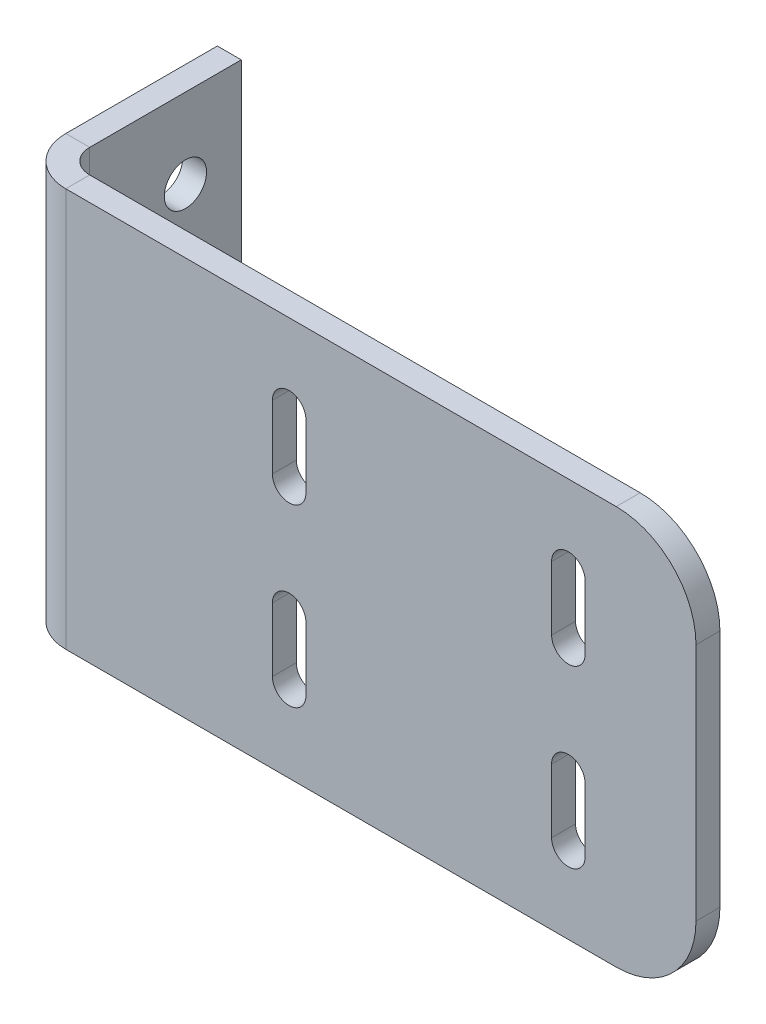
ISO-10303-21;
HEADER;
FILE_DESCRIPTION(('STEP AP214'),'2;1');
FILE_NAME('part.step','',(''),(''),'','','');
FILE_SCHEMA(('AUTOMOTIVE_DESIGN { 1 0 10303 214 1 1 1 1 }'));
ENDSEC;
DATA;
#1=APPLICATION_CONTEXT('core data for automotive mechanical design processes');
#2=APPLICATION_PROTOCOL_DEFINITION('international standard','automotive_design',2000,#1);
#3=PRODUCT_CONTEXT('',#1,'mechanical');
#4=PRODUCT('Part','Part','',(#3));
#5=PRODUCT_RELATED_PRODUCT_CATEGORY('part','',(#4));
#6=PRODUCT_DEFINITION_FORMATION('','',#4);
#7=PRODUCT_DEFINITION_CONTEXT('part definition',#1,'design');
#8=PRODUCT_DEFINITION('design','',#6,#7);
#9=PRODUCT_DEFINITION_SHAPE('','',#8);
#10=(LENGTH_UNIT() NAMED_UNIT(*) SI_UNIT(.MILLI.,.METRE.));
#11=(NAMED_UNIT(*) PLANE_ANGLE_UNIT() SI_UNIT($,.RADIAN.));
#12=(NAMED_UNIT(*) SI_UNIT($,.STERADIAN.) SOLID_ANGLE_UNIT());
#13=UNCERTAINTY_MEASURE_WITH_UNIT(LENGTH_MEASURE(1.E-05),#10,'distance_accuracy_value','');
#14=(GEOMETRIC_REPRESENTATION_CONTEXT(3) GLOBAL_UNCERTAINTY_ASSIGNED_CONTEXT((#13)) GLOBAL_UNIT_ASSIGNED_CONTEXT((#10,
#11,#12)) REPRESENTATION_CONTEXT('',''));
#15=CARTESIAN_POINT('',(0.,0.,0.));
#16=DIRECTION('',(0.,0.,1.));
#17=DIRECTION('',(1.,0.,0.));
#18=AXIS2_PLACEMENT_3D('',#15,#16,#17);
#19=CARTESIAN_POINT('',(0.,50.,3.));
#20=DIRECTION('',(0.,0.,-1.));
#21=DIRECTION('',(-1.,0.,0.));
#22=AXIS2_PLACEMENT_3D('',#19,#20,#21);
#23=PLANE('',#22);
#24=CARTESIAN_POINT('',(66.,18.,3.));
#25=DIRECTION('',(0.,0.,1.));
#26=DIRECTION('',(1.,0.,0.));
#27=AXIS2_PLACEMENT_3D('',#24,#25,#26);
#28=CIRCLE('',#27,2.1);
#29=CARTESIAN_POINT('',(68.1,18.,3.));
#30=VERTEX_POINT('',#29);
#31=CARTESIAN_POINT('',(63.9,18.,3.));
#32=VERTEX_POINT('',#31);
#33=EDGE_CURVE('E277',#30,#32,#28,.T.);
#34=ORIENTED_EDGE('',*,*,#33,.F.);
#35=DIRECTION('',(0.,1.,0.));
#36=VECTOR('',#35,1.);
#37=CARTESIAN_POINT('',(68.1,18.,3.));
#38=LINE('',#37,#36);
#39=CARTESIAN_POINT('',(68.1,10.,3.));
#40=VERTEX_POINT('',#39);
#41=EDGE_CURVE('E285',#40,#30,#38,.T.);
#42=ORIENTED_EDGE('',*,*,#41,.F.);
#43=CARTESIAN_POINT('',(66.,10.,3.));
#44=DIRECTION('',(0.,0.,1.));
#45=DIRECTION('',(1.,0.,0.));
#46=AXIS2_PLACEMENT_3D('',#43,#44,#45);
#47=CIRCLE('',#46,2.1);
#48=CARTESIAN_POINT('',(63.9,10.,3.));
#49=VERTEX_POINT('',#48);
#50=EDGE_CURVE('E282',#49,#40,#47,.T.);
#51=ORIENTED_EDGE('',*,*,#50,.F.);
#52=DIRECTION('',(0.,-1.,0.));
#53=VECTOR('',#52,1.);
#54=CARTESIAN_POINT('',(63.9,18.,3.));
#55=LINE('',#54,#53);
#56=EDGE_CURVE('E279',#32,#49,#55,.T.);
#57=ORIENTED_EDGE('',*,*,#56,.F.);
#58=EDGE_LOOP('',(#34,#42,#51,#57));
#59=FACE_BOUND('',#58,.T.);
#60=CARTESIAN_POINT('',(31.,18.,3.));
#61=DIRECTION('',(0.,0.,1.));
#62=DIRECTION('',(1.,0.,0.));
#63=AXIS2_PLACEMENT_3D('',#60,#61,#62);
#64=CIRCLE('',#63,2.10000000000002);
#65=CARTESIAN_POINT('',(33.1,18.,3.));
#66=VERTEX_POINT('',#65);
#67=CARTESIAN_POINT('',(28.9,18.,3.));
#68=VERTEX_POINT('',#67);
#69=EDGE_CURVE('E339',#66,#68,#64,.T.);
#70=ORIENTED_EDGE('',*,*,#69,.F.);
#71=DIRECTION('',(0.,1.,0.));
#72=VECTOR('',#71,1.);
#73=CARTESIAN_POINT('',(33.1,18.,3.));
#74=LINE('',#73,#72);
#75=CARTESIAN_POINT('',(33.1,10.,3.));
#76=VERTEX_POINT('',#75);
#77=EDGE_CURVE('E347',#76,#66,#74,.T.);
#78=ORIENTED_EDGE('',*,*,#77,.F.);
#79=CARTESIAN_POINT('',(31.,10.,3.));
#80=DIRECTION('',(0.,0.,1.));
#81=DIRECTION('',(1.,0.,0.));
#82=AXIS2_PLACEMENT_3D('',#79,#80,#81);
#83=CIRCLE('',#82,2.10000000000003);
#84=CARTESIAN_POINT('',(28.9,10.,3.));
#85=VERTEX_POINT('',#84);
#86=EDGE_CURVE('E344',#85,#76,#83,.T.);
#87=ORIENTED_EDGE('',*,*,#86,.F.);
#88=DIRECTION('',(0.,-1.,0.));
#89=VECTOR('',#88,1.);
#90=CARTESIAN_POINT('',(28.9,18.,3.));
#91=LINE('',#90,#89);
#92=EDGE_CURVE('E341',#68,#85,#91,.T.);
#93=ORIENTED_EDGE('',*,*,#92,.F.);
#94=EDGE_LOOP('',(#70,#78,#87,#93));
#95=FACE_BOUND('',#94,.T.);
#96=CARTESIAN_POINT('',(31.,40.,3.));
#97=DIRECTION('',(0.,0.,1.));
#98=DIRECTION('',(1.,0.,0.));
#99=AXIS2_PLACEMENT_3D('',#96,#97,#98);
#100=CIRCLE('',#99,2.10000000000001);
#101=CARTESIAN_POINT('',(33.1,40.,3.));
#102=VERTEX_POINT('',#101);
#103=CARTESIAN_POINT('',(28.9,40.,3.));
#104=VERTEX_POINT('',#103);
#105=EDGE_CURVE('E370',#102,#104,#100,.T.);
#106=ORIENTED_EDGE('',*,*,#105,.F.);
#107=DIRECTION('',(0.,1.,0.));
#108=VECTOR('',#107,1.);
#109=CARTESIAN_POINT('',(33.1,40.,3.));
#110=LINE('',#109,#108);
#111=CARTESIAN_POINT('',(33.1,32.,3.));
#112=VERTEX_POINT('',#111);
#113=EDGE_CURVE('E378',#112,#102,#110,.T.);
#114=ORIENTED_EDGE('',*,*,#113,.F.);
#115=CARTESIAN_POINT('',(31.,32.,3.));
#116=DIRECTION('',(0.,0.,1.));
#117=DIRECTION('',(1.,0.,0.));
#118=AXIS2_PLACEMENT_3D('',#115,#116,#117);
#119=CIRCLE('',#118,2.10000000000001);
#120=CARTESIAN_POINT('',(28.9,32.,3.));
#121=VERTEX_POINT('',#120);
#122=EDGE_CURVE('E375',#121,#112,#119,.T.);
#123=ORIENTED_EDGE('',*,*,#122,.F.);
#124=DIRECTION('',(0.,-1.,0.));
#125=VECTOR('',#124,1.);
#126=CARTESIAN_POINT('',(28.9,40.,3.));
#127=LINE('',#126,#125);
#128=EDGE_CURVE('E372',#104,#121,#127,.T.);
#129=ORIENTED_EDGE('',*,*,#128,.F.);
#130=EDGE_LOOP('',(#106,#114,#123,#129));
#131=FACE_BOUND('',#130,.T.);
#132=CARTESIAN_POINT('',(66.,40.,3.));
#133=DIRECTION('',(0.,0.,1.));
#134=DIRECTION('',(1.,0.,0.));
#135=AXIS2_PLACEMENT_3D('',#132,#133,#134);
#136=CIRCLE('',#135,2.10000000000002);
#137=CARTESIAN_POINT('',(68.1,40.,3.));
#138=VERTEX_POINT('',#137);
#139=CARTESIAN_POINT('',(63.9,40.,3.));
#140=VERTEX_POINT('',#139);
#141=EDGE_CURVE('E308',#138,#140,#136,.T.);
#142=ORIENTED_EDGE('',*,*,#141,.F.);
#143=DIRECTION('',(0.,1.,0.));
#144=VECTOR('',#143,1.);
#145=CARTESIAN_POINT('',(68.1,40.,3.));
#146=LINE('',#145,#144);
#147=CARTESIAN_POINT('',(68.1,32.,3.));
#148=VERTEX_POINT('',#147);
#149=EDGE_CURVE('E316',#148,#138,#146,.T.);
#150=ORIENTED_EDGE('',*,*,#149,.F.);
#151=CARTESIAN_POINT('',(66.,32.,3.));
#152=DIRECTION('',(0.,0.,1.));
#153=DIRECTION('',(1.,0.,0.));
#154=AXIS2_PLACEMENT_3D('',#151,#152,#153);
#155=CIRCLE('',#154,2.10000000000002);
#156=CARTESIAN_POINT('',(63.9,32.,3.));
#157=VERTEX_POINT('',#156);
#158=EDGE_CURVE('E313',#157,#148,#155,.T.);
#159=ORIENTED_EDGE('',*,*,#158,.F.);
#160=DIRECTION('',(0.,-1.,0.));
#161=VECTOR('',#160,1.);
#162=CARTESIAN_POINT('',(63.9,40.,3.));
#163=LINE('',#162,#161);
#164=EDGE_CURVE('E310',#140,#157,#163,.T.);
#165=ORIENTED_EDGE('',*,*,#164,.F.);
#166=EDGE_LOOP('',(#142,#150,#159,#165));
#167=FACE_BOUND('',#166,.T.);
#168=DIRECTION('',(0.,1.,0.));
#169=VECTOR('',#168,1.);
#170=CARTESIAN_POINT('',(82.,0.,3.));
#171=LINE('',#170,#169);
#172=CARTESIAN_POINT('',(82.,10.,3.));
#173=VERTEX_POINT('',#172);
#174=CARTESIAN_POINT('',(82.,40.,3.));
#175=VERTEX_POINT('',#174);
#176=EDGE_CURVE('E403',#173,#175,#171,.T.);
#177=ORIENTED_EDGE('',*,*,#176,.T.);
#178=CARTESIAN_POINT('',(72.,40.,3.));
#179=DIRECTION('',(0.,0.,-1.));
#180=DIRECTION('',(-1.,0.,0.));
#181=AXIS2_PLACEMENT_3D('',#178,#179,#180);
#182=CIRCLE('',#181,10.);
#183=CARTESIAN_POINT('',(72.,50.,3.));
#184=VERTEX_POINT('',#183);
#185=EDGE_CURVE('E42',#175,#184,#182,.F.);
#186=ORIENTED_EDGE('',*,*,#185,.T.);
#187=DIRECTION('',(-1.,0.,0.));
#188=VECTOR('',#187,1.);
#189=CARTESIAN_POINT('',(0.,50.,3.));
#190=LINE('',#189,#188);
#191=CARTESIAN_POINT('',(2.99999999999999,50.,3.));
#192=VERTEX_POINT('',#191);
#193=EDGE_CURVE('E406',#184,#192,#190,.T.);
#194=ORIENTED_EDGE('',*,*,#193,.T.);
#195=DIRECTION('',(0.,1.,0.));
#196=VECTOR('',#195,1.);
#197=CARTESIAN_POINT('',(2.99999999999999,50.,3.));
#198=LINE('',#197,#196);
#199=CARTESIAN_POINT('',(2.99999999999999,0.,3.));
#200=VERTEX_POINT('',#199);
#201=EDGE_CURVE('E216',#192,#200,#198,.F.);
#202=ORIENTED_EDGE('',*,*,#201,.T.);
#203=DIRECTION('',(1.,0.,0.));
#204=VECTOR('',#203,1.);
#205=CARTESIAN_POINT('',(0.,0.,3.));
#206=LINE('',#205,#204);
#207=CARTESIAN_POINT('',(72.,0.,3.));
#208=VERTEX_POINT('',#207);
#209=EDGE_CURVE('E401',#200,#208,#206,.T.);
#210=ORIENTED_EDGE('',*,*,#209,.T.);
#211=CARTESIAN_POINT('',(72.,10.,3.));
#212=DIRECTION('',(0.,0.,-1.));
#213=DIRECTION('',(-1.,0.,0.));
#214=AXIS2_PLACEMENT_3D('',#211,#212,#213);
#215=CIRCLE('',#214,10.);
#216=EDGE_CURVE('E423',#208,#173,#215,.F.);
#217=ORIENTED_EDGE('',*,*,#216,.T.);
#218=EDGE_LOOP('',(#177,#186,#194,#202,#210,#217));
#219=FACE_BOUND('',#218,.T.);
#220=ADVANCED_FACE('F34',(#59,#95,#131,#167,#219),#23,.F.);
#221=CARTESIAN_POINT('',(0.,50.,0.));
#222=DIRECTION('',(0.,0.,-1.));
#223=DIRECTION('',(-1.,0.,0.));
#224=AXIS2_PLACEMENT_3D('',#221,#222,#223);
#225=PLANE('',#224);
#226=DIRECTION('',(0.,1.,0.));
#227=VECTOR('',#226,1.);
#228=CARTESIAN_POINT('',(68.1,18.,0.));
#229=LINE('',#228,#227);
#230=CARTESIAN_POINT('',(68.1,10.,0.));
#231=VERTEX_POINT('',#230);
#232=CARTESIAN_POINT('',(68.1,18.,0.));
#233=VERTEX_POINT('',#232);
#234=EDGE_CURVE('E280',#231,#233,#229,.T.);
#235=ORIENTED_EDGE('',*,*,#234,.T.);
#236=CARTESIAN_POINT('',(66.,18.,0.));
#237=DIRECTION('',(0.,0.,1.));
#238=DIRECTION('',(1.,0.,0.));
#239=AXIS2_PLACEMENT_3D('',#236,#237,#238);
#240=CIRCLE('',#239,2.1);
#241=CARTESIAN_POINT('',(63.9,18.,0.));
#242=VERTEX_POINT('',#241);
#243=EDGE_CURVE('E274',#233,#242,#240,.T.);
#244=ORIENTED_EDGE('',*,*,#243,.T.);
#245=DIRECTION('',(0.,-1.,0.));
#246=VECTOR('',#245,1.);
#247=CARTESIAN_POINT('',(63.9,18.,0.));
#248=LINE('',#247,#246);
#249=CARTESIAN_POINT('',(63.9,10.,0.));
#250=VERTEX_POINT('',#249);
#251=EDGE_CURVE('E290',#242,#250,#248,.T.);
#252=ORIENTED_EDGE('',*,*,#251,.T.);
#253=CARTESIAN_POINT('',(66.,10.,0.));
#254=DIRECTION('',(0.,0.,1.));
#255=DIRECTION('',(1.,0.,0.));
#256=AXIS2_PLACEMENT_3D('',#253,#254,#255);
#257=CIRCLE('',#256,2.1);
#258=EDGE_CURVE('E293',#250,#231,#257,.T.);
#259=ORIENTED_EDGE('',*,*,#258,.T.);
#260=EDGE_LOOP('',(#235,#244,#252,#259));
#261=FACE_BOUND('',#260,.T.);
#262=DIRECTION('',(0.,1.,0.));
#263=VECTOR('',#262,1.);
#264=CARTESIAN_POINT('',(33.1,18.,0.));
#265=LINE('',#264,#263);
#266=CARTESIAN_POINT('',(33.1,10.,0.));
#267=VERTEX_POINT('',#266);
#268=CARTESIAN_POINT('',(33.1,18.,0.));
#269=VERTEX_POINT('',#268);
#270=EDGE_CURVE('E342',#267,#269,#265,.T.);
#271=ORIENTED_EDGE('',*,*,#270,.T.);
#272=CARTESIAN_POINT('',(31.,18.,0.));
#273=DIRECTION('',(0.,0.,1.));
#274=DIRECTION('',(1.,0.,0.));
#275=AXIS2_PLACEMENT_3D('',#272,#273,#274);
#276=CIRCLE('',#275,2.10000000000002);
#277=CARTESIAN_POINT('',(28.9,18.,0.));
#278=VERTEX_POINT('',#277);
#279=EDGE_CURVE('E338',#269,#278,#276,.T.);
#280=ORIENTED_EDGE('',*,*,#279,.T.);
#281=DIRECTION('',(0.,-1.,0.));
#282=VECTOR('',#281,1.);
#283=CARTESIAN_POINT('',(28.9,18.,0.));
#284=LINE('',#283,#282);
#285=CARTESIAN_POINT('',(28.9,10.,0.));
#286=VERTEX_POINT('',#285);
#287=EDGE_CURVE('E352',#278,#286,#284,.T.);
#288=ORIENTED_EDGE('',*,*,#287,.T.);
#289=CARTESIAN_POINT('',(31.,10.,0.));
#290=DIRECTION('',(0.,0.,1.));
#291=DIRECTION('',(1.,0.,0.));
#292=AXIS2_PLACEMENT_3D('',#289,#290,#291);
#293=CIRCLE('',#292,2.10000000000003);
#294=EDGE_CURVE('E355',#286,#267,#293,.T.);
#295=ORIENTED_EDGE('',*,*,#294,.T.);
#296=EDGE_LOOP('',(#271,#280,#288,#295));
#297=FACE_BOUND('',#296,.T.);
#298=DIRECTION('',(0.,1.,0.));
#299=VECTOR('',#298,1.);
#300=CARTESIAN_POINT('',(33.1,40.,0.));
#301=LINE('',#300,#299);
#302=CARTESIAN_POINT('',(33.1,32.,0.));
#303=VERTEX_POINT('',#302);
#304=CARTESIAN_POINT('',(33.1,40.,0.));
#305=VERTEX_POINT('',#304);
#306=EDGE_CURVE('E373',#303,#305,#301,.T.);
#307=ORIENTED_EDGE('',*,*,#306,.T.);
#308=CARTESIAN_POINT('',(31.,40.,0.));
#309=DIRECTION('',(0.,0.,1.));
#310=DIRECTION('',(1.,0.,0.));
#311=AXIS2_PLACEMENT_3D('',#308,#309,#310);
#312=CIRCLE('',#311,2.10000000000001);
#313=CARTESIAN_POINT('',(28.9,40.,0.));
#314=VERTEX_POINT('',#313);
#315=EDGE_CURVE('E369',#305,#314,#312,.T.);
#316=ORIENTED_EDGE('',*,*,#315,.T.);
#317=DIRECTION('',(0.,-1.,0.));
#318=VECTOR('',#317,1.);
#319=CARTESIAN_POINT('',(28.9,40.,0.));
#320=LINE('',#319,#318);
#321=CARTESIAN_POINT('',(28.9,32.,0.));
#322=VERTEX_POINT('',#321);
#323=EDGE_CURVE('E383',#314,#322,#320,.T.);
#324=ORIENTED_EDGE('',*,*,#323,.T.);
#325=CARTESIAN_POINT('',(31.,32.,0.));
#326=DIRECTION('',(0.,0.,1.));
#327=DIRECTION('',(1.,0.,0.));
#328=AXIS2_PLACEMENT_3D('',#325,#326,#327);
#329=CIRCLE('',#328,2.10000000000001);
#330=EDGE_CURVE('E386',#322,#303,#329,.T.);
#331=ORIENTED_EDGE('',*,*,#330,.T.);
#332=EDGE_LOOP('',(#307,#316,#324,#331));
#333=FACE_BOUND('',#332,.T.);
#334=DIRECTION('',(0.,1.,0.));
#335=VECTOR('',#334,1.);
#336=CARTESIAN_POINT('',(68.1,40.,0.));
#337=LINE('',#336,#335);
#338=CARTESIAN_POINT('',(68.1,32.,0.));
#339=VERTEX_POINT('',#338);
#340=CARTESIAN_POINT('',(68.1,40.,0.));
#341=VERTEX_POINT('',#340);
#342=EDGE_CURVE('E311',#339,#341,#337,.T.);
#343=ORIENTED_EDGE('',*,*,#342,.T.);
#344=CARTESIAN_POINT('',(66.,40.,0.));
#345=DIRECTION('',(0.,0.,1.));
#346=DIRECTION('',(1.,0.,0.));
#347=AXIS2_PLACEMENT_3D('',#344,#345,#346);
#348=CIRCLE('',#347,2.10000000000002);
#349=CARTESIAN_POINT('',(63.9,40.,0.));
#350=VERTEX_POINT('',#349);
#351=EDGE_CURVE('E307',#341,#350,#348,.T.);
#352=ORIENTED_EDGE('',*,*,#351,.T.);
#353=DIRECTION('',(0.,-1.,0.));
#354=VECTOR('',#353,1.);
#355=CARTESIAN_POINT('',(63.9,40.,0.));
#356=LINE('',#355,#354);
#357=CARTESIAN_POINT('',(63.9,32.,0.));
#358=VERTEX_POINT('',#357);
#359=EDGE_CURVE('E321',#350,#358,#356,.T.);
#360=ORIENTED_EDGE('',*,*,#359,.T.);
#361=CARTESIAN_POINT('',(66.,32.,0.));
#362=DIRECTION('',(0.,0.,1.));
#363=DIRECTION('',(1.,0.,0.));
#364=AXIS2_PLACEMENT_3D('',#361,#362,#363);
#365=CIRCLE('',#364,2.10000000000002);
#366=EDGE_CURVE('E324',#358,#339,#365,.T.);
#367=ORIENTED_EDGE('',*,*,#366,.T.);
#368=EDGE_LOOP('',(#343,#352,#360,#367));
#369=FACE_BOUND('',#368,.T.);
#370=DIRECTION('',(-1.,0.,0.));
#371=VECTOR('',#370,1.);
#372=CARTESIAN_POINT('',(0.,50.,0.));
#373=LINE('',#372,#371);
#374=CARTESIAN_POINT('',(72.,50.,0.));
#375=VERTEX_POINT('',#374);
#376=CARTESIAN_POINT('',(2.99999999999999,50.,0.));
#377=VERTEX_POINT('',#376);
#378=EDGE_CURVE('E404',#375,#377,#373,.T.);
#379=ORIENTED_EDGE('',*,*,#378,.F.);
#380=CARTESIAN_POINT('',(72.,40.,0.));
#381=DIRECTION('',(0.,0.,-1.));
#382=DIRECTION('',(-1.,0.,0.));
#383=AXIS2_PLACEMENT_3D('',#380,#381,#382);
#384=CIRCLE('',#383,10.);
#385=CARTESIAN_POINT('',(82.,40.,0.));
#386=VERTEX_POINT('',#385);
#387=EDGE_CURVE('E417',#375,#386,#384,.T.);
#388=ORIENTED_EDGE('',*,*,#387,.T.);
#389=DIRECTION('',(0.,1.,0.));
#390=VECTOR('',#389,1.);
#391=CARTESIAN_POINT('',(82.,0.,0.));
#392=LINE('',#391,#390);
#393=CARTESIAN_POINT('',(82.,10.,0.));
#394=VERTEX_POINT('',#393);
#395=EDGE_CURVE('E410',#394,#386,#392,.T.);
#396=ORIENTED_EDGE('',*,*,#395,.F.);
#397=CARTESIAN_POINT('',(72.,10.,0.));
#398=DIRECTION('',(0.,0.,-1.));
#399=DIRECTION('',(-1.,0.,0.));
#400=AXIS2_PLACEMENT_3D('',#397,#398,#399);
#401=CIRCLE('',#400,10.);
#402=CARTESIAN_POINT('',(72.,0.,0.));
#403=VERTEX_POINT('',#402);
#404=EDGE_CURVE('E415',#394,#403,#401,.T.);
#405=ORIENTED_EDGE('',*,*,#404,.T.);
#406=DIRECTION('',(1.,0.,0.));
#407=VECTOR('',#406,1.);
#408=CARTESIAN_POINT('',(0.,0.,0.));
#409=LINE('',#408,#407);
#410=CARTESIAN_POINT('',(2.99999999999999,0.,0.));
#411=VERTEX_POINT('',#410);
#412=EDGE_CURVE('E400',#411,#403,#409,.T.);
#413=ORIENTED_EDGE('',*,*,#412,.F.);
#414=DIRECTION('',(0.,1.,0.));
#415=VECTOR('',#414,1.);
#416=CARTESIAN_POINT('',(2.99999999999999,50.,0.));
#417=LINE('',#416,#415);
#418=EDGE_CURVE('E267',#377,#411,#417,.F.);
#419=ORIENTED_EDGE('',*,*,#418,.F.);
#420=EDGE_LOOP('',(#379,#388,#396,#405,#413,#419));
#421=FACE_BOUND('',#420,.T.);
#422=ADVANCED_FACE('F435',(#261,#297,#333,#369,#421),#225,.T.);
#423=CARTESIAN_POINT('',(0.,0.,3.));
#424=DIRECTION('',(0.,1.,0.));
#425=DIRECTION('',(0.,0.,1.));
#426=AXIS2_PLACEMENT_3D('',#423,#424,#425);
#427=PLANE('',#426);
#428=ORIENTED_EDGE('',*,*,#412,.T.);
#429=DIRECTION('',(0.,0.,-1.));
#430=VECTOR('',#429,1.);
#431=CARTESIAN_POINT('',(72.,0.,3.));
#432=LINE('',#431,#430);
#433=EDGE_CURVE('E11',#403,#208,#432,.F.);
#434=ORIENTED_EDGE('',*,*,#433,.T.);
#435=ORIENTED_EDGE('',*,*,#209,.F.);
#436=DIRECTION('',(0.,0.,1.));
#437=VECTOR('',#436,1.);
#438=CARTESIAN_POINT('',(2.99999999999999,0.,0.));
#439=LINE('',#438,#437);
#440=EDGE_CURVE('E271',#411,#200,#439,.T.);
#441=ORIENTED_EDGE('',*,*,#440,.F.);
#442=EDGE_LOOP('',(#428,#434,#435,#441));
#443=FACE_BOUND('',#442,.T.);
#444=ADVANCED_FACE('F442',(#443),#427,.F.);
#445=CARTESIAN_POINT('',(0.,50.,3.));
#446=DIRECTION('',(0.,-1.,0.));
#447=DIRECTION('',(0.,0.,-1.));
#448=AXIS2_PLACEMENT_3D('',#445,#446,#447);
#449=PLANE('',#448);
#450=ORIENTED_EDGE('',*,*,#193,.F.);
#451=DIRECTION('',(0.,0.,-1.));
#452=VECTOR('',#451,1.);
#453=CARTESIAN_POINT('',(72.,50.,3.));
#454=LINE('',#453,#452);
#455=EDGE_CURVE('E408',#184,#375,#454,.T.);
#456=ORIENTED_EDGE('',*,*,#455,.T.);
#457=ORIENTED_EDGE('',*,*,#378,.T.);
#458=DIRECTION('',(0.,0.,1.));
#459=VECTOR('',#458,1.);
#460=CARTESIAN_POINT('',(2.99999999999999,50.,0.));
#461=LINE('',#460,#459);
#462=EDGE_CURVE('E263',#377,#192,#461,.T.);
#463=ORIENTED_EDGE('',*,*,#462,.T.);
#464=EDGE_LOOP('',(#450,#456,#457,#463));
#465=FACE_BOUND('',#464,.T.);
#466=ADVANCED_FACE('F430',(#465),#449,.F.);
#467=CARTESIAN_POINT('',(82.,0.,3.));
#468=DIRECTION('',(-1.,0.,0.));
#469=DIRECTION('',(0.,0.,1.));
#470=AXIS2_PLACEMENT_3D('',#467,#468,#469);
#471=PLANE('',#470);
#472=ORIENTED_EDGE('',*,*,#395,.T.);
#473=DIRECTION('',(0.,0.,-1.));
#474=VECTOR('',#473,1.);
#475=CARTESIAN_POINT('',(82.,40.,3.));
#476=LINE('',#475,#474);
#477=EDGE_CURVE('E55',#386,#175,#476,.F.);
#478=ORIENTED_EDGE('',*,*,#477,.T.);
#479=ORIENTED_EDGE('',*,*,#176,.F.);
#480=DIRECTION('',(0.,0.,-1.));
#481=VECTOR('',#480,1.);
#482=CARTESIAN_POINT('',(82.,10.,3.));
#483=LINE('',#482,#481);
#484=EDGE_CURVE('E419',#173,#394,#483,.T.);
#485=ORIENTED_EDGE('',*,*,#484,.T.);
#486=EDGE_LOOP('',(#472,#478,#479,#485));
#487=FACE_BOUND('',#486,.T.);
#488=ADVANCED_FACE('F437',(#487),#471,.F.);
#489=CARTESIAN_POINT('',(31.,40.,3.));
#490=DIRECTION('',(0.,0.,-1.));
#491=DIRECTION('',(-1.,0.,0.));
#492=AXIS2_PLACEMENT_3D('',#489,#490,#491);
#493=CYLINDRICAL_SURFACE('',#492,2.10000000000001);
#494=ORIENTED_EDGE('',*,*,#315,.F.);
#495=DIRECTION('',(0.,0.,-1.));
#496=VECTOR('',#495,1.);
#497=CARTESIAN_POINT('',(33.1,40.,3.));
#498=LINE('',#497,#496);
#499=EDGE_CURVE('E380',#102,#305,#498,.T.);
#500=ORIENTED_EDGE('',*,*,#499,.F.);
#501=ORIENTED_EDGE('',*,*,#105,.T.);
#502=DIRECTION('',(0.,0.,-1.));
#503=VECTOR('',#502,1.);
#504=CARTESIAN_POINT('',(28.9,40.,3.));
#505=LINE('',#504,#503);
#506=EDGE_CURVE('E397',#104,#314,#505,.T.);
#507=ORIENTED_EDGE('',*,*,#506,.T.);
#508=EDGE_LOOP('',(#494,#500,#501,#507));
#509=FACE_BOUND('',#508,.T.);
#510=ADVANCED_FACE('F482',(#509),#493,.F.);
#511=CARTESIAN_POINT('',(28.9,40.,3.));
#512=DIRECTION('',(1.,0.,0.));
#513=DIRECTION('',(0.,0.,-1.));
#514=AXIS2_PLACEMENT_3D('',#511,#512,#513);
#515=PLANE('',#514);
#516=ORIENTED_EDGE('',*,*,#323,.F.);
#517=ORIENTED_EDGE('',*,*,#506,.F.);
#518=ORIENTED_EDGE('',*,*,#128,.T.);
#519=DIRECTION('',(0.,0.,-1.));
#520=VECTOR('',#519,1.);
#521=CARTESIAN_POINT('',(28.9,32.,3.));
#522=LINE('',#521,#520);
#523=EDGE_CURVE('E395',#121,#322,#522,.T.);
#524=ORIENTED_EDGE('',*,*,#523,.T.);
#525=EDGE_LOOP('',(#516,#517,#518,#524));
#526=FACE_BOUND('',#525,.T.);
#527=ADVANCED_FACE('F509',(#526),#515,.T.);
#528=CARTESIAN_POINT('',(31.,32.,3.));
#529=DIRECTION('',(0.,0.,-1.));
#530=DIRECTION('',(-1.,0.,0.));
#531=AXIS2_PLACEMENT_3D('',#528,#529,#530);
#532=CYLINDRICAL_SURFACE('',#531,2.10000000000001);
#533=ORIENTED_EDGE('',*,*,#330,.F.);
#534=ORIENTED_EDGE('',*,*,#523,.F.);
#535=ORIENTED_EDGE('',*,*,#122,.T.);
#536=DIRECTION('',(0.,0.,-1.));
#537=VECTOR('',#536,1.);
#538=CARTESIAN_POINT('',(33.1,32.,3.));
#539=LINE('',#538,#537);
#540=EDGE_CURVE('E393',#112,#303,#539,.T.);
#541=ORIENTED_EDGE('',*,*,#540,.T.);
#542=EDGE_LOOP('',(#533,#534,#535,#541));
#543=FACE_BOUND('',#542,.T.);
#544=ADVANCED_FACE('F516',(#543),#532,.F.);
#545=CARTESIAN_POINT('',(33.1,40.,3.));
#546=DIRECTION('',(-1.,0.,0.));
#547=DIRECTION('',(0.,0.,1.));
#548=AXIS2_PLACEMENT_3D('',#545,#546,#547);
#549=PLANE('',#548);
#550=ORIENTED_EDGE('',*,*,#306,.F.);
#551=ORIENTED_EDGE('',*,*,#540,.F.);
#552=ORIENTED_EDGE('',*,*,#113,.T.);
#553=ORIENTED_EDGE('',*,*,#499,.T.);
#554=EDGE_LOOP('',(#550,#551,#552,#553));
#555=FACE_BOUND('',#554,.T.);
#556=ADVANCED_FACE('F523',(#555),#549,.T.);
#557=CARTESIAN_POINT('',(31.,18.,3.));
#558=DIRECTION('',(0.,0.,-1.));
#559=DIRECTION('',(-1.,0.,0.));
#560=AXIS2_PLACEMENT_3D('',#557,#558,#559);
#561=CYLINDRICAL_SURFACE('',#560,2.10000000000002);
#562=ORIENTED_EDGE('',*,*,#279,.F.);
#563=DIRECTION('',(0.,0.,-1.));
#564=VECTOR('',#563,1.);
#565=CARTESIAN_POINT('',(33.1,18.,3.));
#566=LINE('',#565,#564);
#567=EDGE_CURVE('E349',#66,#269,#566,.T.);
#568=ORIENTED_EDGE('',*,*,#567,.F.);
#569=ORIENTED_EDGE('',*,*,#69,.T.);
#570=DIRECTION('',(0.,0.,-1.));
#571=VECTOR('',#570,1.);
#572=CARTESIAN_POINT('',(28.9,18.,3.));
#573=LINE('',#572,#571);
#574=EDGE_CURVE('E366',#68,#278,#573,.T.);
#575=ORIENTED_EDGE('',*,*,#574,.T.);
#576=EDGE_LOOP('',(#562,#568,#569,#575));
#577=FACE_BOUND('',#576,.T.);
#578=ADVANCED_FACE('F531',(#577),#561,.F.);
#579=CARTESIAN_POINT('',(28.9,18.,3.));
#580=DIRECTION('',(1.,0.,0.));
#581=DIRECTION('',(0.,1.,0.));
#582=AXIS2_PLACEMENT_3D('',#579,#580,#581);
#583=PLANE('',#582);
#584=ORIENTED_EDGE('',*,*,#287,.F.);
#585=ORIENTED_EDGE('',*,*,#574,.F.);
#586=ORIENTED_EDGE('',*,*,#92,.T.);
#587=DIRECTION('',(0.,0.,-1.));
#588=VECTOR('',#587,1.);
#589=CARTESIAN_POINT('',(28.9,10.,3.));
#590=LINE('',#589,#588);
#591=EDGE_CURVE('E364',#85,#286,#590,.T.);
#592=ORIENTED_EDGE('',*,*,#591,.T.);
#593=EDGE_LOOP('',(#584,#585,#586,#592));
#594=FACE_BOUND('',#593,.T.);
#595=ADVANCED_FACE('F539',(#594),#583,.T.);
#596=CARTESIAN_POINT('',(31.,10.,3.));
#597=DIRECTION('',(0.,0.,-1.));
#598=DIRECTION('',(-1.,0.,0.));
#599=AXIS2_PLACEMENT_3D('',#596,#597,#598);
#600=CYLINDRICAL_SURFACE('',#599,2.10000000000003);
#601=ORIENTED_EDGE('',*,*,#294,.F.);
#602=ORIENTED_EDGE('',*,*,#591,.F.);
#603=ORIENTED_EDGE('',*,*,#86,.T.);
#604=DIRECTION('',(0.,0.,-1.));
#605=VECTOR('',#604,1.);
#606=CARTESIAN_POINT('',(33.1,10.,3.));
#607=LINE('',#606,#605);
#608=EDGE_CURVE('E362',#76,#267,#607,.T.);
#609=ORIENTED_EDGE('',*,*,#608,.T.);
#610=EDGE_LOOP('',(#601,#602,#603,#609));
#611=FACE_BOUND('',#610,.T.);
#612=ADVANCED_FACE('F547',(#611),#600,.F.);
#613=CARTESIAN_POINT('',(33.1,18.,3.));
#614=DIRECTION('',(-1.,0.,0.));
#615=DIRECTION('',(0.,-1.,0.));
#616=AXIS2_PLACEMENT_3D('',#613,#614,#615);
#617=PLANE('',#616);
#618=ORIENTED_EDGE('',*,*,#270,.F.);
#619=ORIENTED_EDGE('',*,*,#608,.F.);
#620=ORIENTED_EDGE('',*,*,#77,.T.);
#621=ORIENTED_EDGE('',*,*,#567,.T.);
#622=EDGE_LOOP('',(#618,#619,#620,#621));
#623=FACE_BOUND('',#622,.T.);
#624=ADVANCED_FACE('F555',(#623),#617,.T.);
#625=CARTESIAN_POINT('',(66.,40.,3.));
#626=DIRECTION('',(0.,0.,-1.));
#627=DIRECTION('',(-1.,0.,0.));
#628=AXIS2_PLACEMENT_3D('',#625,#626,#627);
#629=CYLINDRICAL_SURFACE('',#628,2.10000000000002);
#630=ORIENTED_EDGE('',*,*,#351,.F.);
#631=DIRECTION('',(0.,0.,-1.));
#632=VECTOR('',#631,1.);
#633=CARTESIAN_POINT('',(68.1,40.,3.));
#634=LINE('',#633,#632);
#635=EDGE_CURVE('E318',#138,#341,#634,.T.);
#636=ORIENTED_EDGE('',*,*,#635,.F.);
#637=ORIENTED_EDGE('',*,*,#141,.T.);
#638=DIRECTION('',(0.,0.,-1.));
#639=VECTOR('',#638,1.);
#640=CARTESIAN_POINT('',(63.9,40.,3.));
#641=LINE('',#640,#639);
#642=EDGE_CURVE('E335',#140,#350,#641,.T.);
#643=ORIENTED_EDGE('',*,*,#642,.T.);
#644=EDGE_LOOP('',(#630,#636,#637,#643));
#645=FACE_BOUND('',#644,.T.);
#646=ADVANCED_FACE('F563',(#645),#629,.F.);
#647=CARTESIAN_POINT('',(63.9,40.,3.));
#648=DIRECTION('',(1.,0.,0.));
#649=DIRECTION('',(0.,0.,-1.));
#650=AXIS2_PLACEMENT_3D('',#647,#648,#649);
#651=PLANE('',#650);
#652=ORIENTED_EDGE('',*,*,#359,.F.);
#653=ORIENTED_EDGE('',*,*,#642,.F.);
#654=ORIENTED_EDGE('',*,*,#164,.T.);
#655=DIRECTION('',(0.,0.,-1.));
#656=VECTOR('',#655,1.);
#657=CARTESIAN_POINT('',(63.9,32.,3.));
#658=LINE('',#657,#656);
#659=EDGE_CURVE('E333',#157,#358,#658,.T.);
#660=ORIENTED_EDGE('',*,*,#659,.T.);
#661=EDGE_LOOP('',(#652,#653,#654,#660));
#662=FACE_BOUND('',#661,.T.);
#663=ADVANCED_FACE('F571',(#662),#651,.T.);
#664=CARTESIAN_POINT('',(66.,32.,3.));
#665=DIRECTION('',(0.,0.,-1.));
#666=DIRECTION('',(-1.,0.,0.));
#667=AXIS2_PLACEMENT_3D('',#664,#665,#666);
#668=CYLINDRICAL_SURFACE('',#667,2.10000000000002);
#669=ORIENTED_EDGE('',*,*,#366,.F.);
#670=ORIENTED_EDGE('',*,*,#659,.F.);
#671=ORIENTED_EDGE('',*,*,#158,.T.);
#672=DIRECTION('',(0.,0.,-1.));
#673=VECTOR('',#672,1.);
#674=CARTESIAN_POINT('',(68.1,32.,3.));
#675=LINE('',#674,#673);
#676=EDGE_CURVE('E331',#148,#339,#675,.T.);
#677=ORIENTED_EDGE('',*,*,#676,.T.);
#678=EDGE_LOOP('',(#669,#670,#671,#677));
#679=FACE_BOUND('',#678,.T.);
#680=ADVANCED_FACE('F579',(#679),#668,.F.);
#681=CARTESIAN_POINT('',(68.1,40.,3.));
#682=DIRECTION('',(-1.,0.,0.));
#683=DIRECTION('',(0.,0.,1.));
#684=AXIS2_PLACEMENT_3D('',#681,#682,#683);
#685=PLANE('',#684);
#686=ORIENTED_EDGE('',*,*,#342,.F.);
#687=ORIENTED_EDGE('',*,*,#676,.F.);
#688=ORIENTED_EDGE('',*,*,#149,.T.);
#689=ORIENTED_EDGE('',*,*,#635,.T.);
#690=EDGE_LOOP('',(#686,#687,#688,#689));
#691=FACE_BOUND('',#690,.T.);
#692=ADVANCED_FACE('F587',(#691),#685,.T.);
#693=CARTESIAN_POINT('',(66.,18.,3.));
#694=DIRECTION('',(0.,0.,-1.));
#695=DIRECTION('',(-1.,0.,0.));
#696=AXIS2_PLACEMENT_3D('',#693,#694,#695);
#697=CYLINDRICAL_SURFACE('',#696,2.1);
#698=ORIENTED_EDGE('',*,*,#243,.F.);
#699=DIRECTION('',(0.,0.,-1.));
#700=VECTOR('',#699,1.);
#701=CARTESIAN_POINT('',(68.1,18.,3.));
#702=LINE('',#701,#700);
#703=EDGE_CURVE('E287',#30,#233,#702,.T.);
#704=ORIENTED_EDGE('',*,*,#703,.F.);
#705=ORIENTED_EDGE('',*,*,#33,.T.);
#706=DIRECTION('',(0.,0.,-1.));
#707=VECTOR('',#706,1.);
#708=CARTESIAN_POINT('',(63.9,18.,3.));
#709=LINE('',#708,#707);
#710=EDGE_CURVE('E304',#32,#242,#709,.T.);
#711=ORIENTED_EDGE('',*,*,#710,.T.);
#712=EDGE_LOOP('',(#698,#704,#705,#711));
#713=FACE_BOUND('',#712,.T.);
#714=ADVANCED_FACE('F595',(#713),#697,.F.);
#715=CARTESIAN_POINT('',(63.9,18.,3.));
#716=DIRECTION('',(1.,0.,0.));
#717=DIRECTION('',(0.,0.,-1.));
#718=AXIS2_PLACEMENT_3D('',#715,#716,#717);
#719=PLANE('',#718);
#720=ORIENTED_EDGE('',*,*,#251,.F.);
#721=ORIENTED_EDGE('',*,*,#710,.F.);
#722=ORIENTED_EDGE('',*,*,#56,.T.);
#723=DIRECTION('',(0.,0.,-1.));
#724=VECTOR('',#723,1.);
#725=CARTESIAN_POINT('',(63.9,10.,3.));
#726=LINE('',#725,#724);
#727=EDGE_CURVE('E302',#49,#250,#726,.T.);
#728=ORIENTED_EDGE('',*,*,#727,.T.);
#729=EDGE_LOOP('',(#720,#721,#722,#728));
#730=FACE_BOUND('',#729,.T.);
#731=ADVANCED_FACE('F603',(#730),#719,.T.);
#732=CARTESIAN_POINT('',(66.,10.,3.));
#733=DIRECTION('',(0.,0.,-1.));
#734=DIRECTION('',(-1.,0.,0.));
#735=AXIS2_PLACEMENT_3D('',#732,#733,#734);
#736=CYLINDRICAL_SURFACE('',#735,2.1);
#737=ORIENTED_EDGE('',*,*,#258,.F.);
#738=ORIENTED_EDGE('',*,*,#727,.F.);
#739=ORIENTED_EDGE('',*,*,#50,.T.);
#740=DIRECTION('',(0.,0.,-1.));
#741=VECTOR('',#740,1.);
#742=CARTESIAN_POINT('',(68.1,10.,3.));
#743=LINE('',#742,#741);
#744=EDGE_CURVE('E300',#40,#231,#743,.T.);
#745=ORIENTED_EDGE('',*,*,#744,.T.);
#746=EDGE_LOOP('',(#737,#738,#739,#745));
#747=FACE_BOUND('',#746,.T.);
#748=ADVANCED_FACE('F611',(#747),#736,.F.);
#749=CARTESIAN_POINT('',(68.1,18.,3.));
#750=DIRECTION('',(-1.,0.,0.));
#751=DIRECTION('',(0.,0.,1.));
#752=AXIS2_PLACEMENT_3D('',#749,#750,#751);
#753=PLANE('',#752);
#754=ORIENTED_EDGE('',*,*,#234,.F.);
#755=ORIENTED_EDGE('',*,*,#744,.F.);
#756=ORIENTED_EDGE('',*,*,#41,.T.);
#757=ORIENTED_EDGE('',*,*,#703,.T.);
#758=EDGE_LOOP('',(#754,#755,#756,#757));
#759=FACE_BOUND('',#758,.T.);
#760=ADVANCED_FACE('F619',(#759),#753,.T.);
#761=CARTESIAN_POINT('',(2.99999999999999,0.,-3.));
#762=DIRECTION('',(0.,-1.,0.));
#763=DIRECTION('',(0.,0.,-1.));
#764=AXIS2_PLACEMENT_3D('',#761,#762,#763);
#765=PLANE('',#764);
#766=DIRECTION('',(-1.,0.,0.));
#767=VECTOR('',#766,1.);
#768=CARTESIAN_POINT('',(0.,0.,-2.99999999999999));
#769=LINE('',#768,#767);
#770=CARTESIAN_POINT('',(0.,0.,-2.99999999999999));
#771=VERTEX_POINT('',#770);
#772=CARTESIAN_POINT('',(-3.00000000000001,0.,-2.99999999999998));
#773=VERTEX_POINT('',#772);
#774=EDGE_CURVE('E447',#771,#773,#769,.T.);
#775=ORIENTED_EDGE('',*,*,#774,.F.);
#776=CARTESIAN_POINT('',(2.99999999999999,0.,-3.));
#777=DIRECTION('',(0.,1.,0.));
#778=DIRECTION('',(0.,0.,1.));
#779=AXIS2_PLACEMENT_3D('',#776,#777,#778);
#780=CIRCLE('',#779,3.);
#781=EDGE_CURVE('E219',#411,#771,#780,.F.);
#782=ORIENTED_EDGE('',*,*,#781,.F.);
#783=ORIENTED_EDGE('',*,*,#440,.T.);
#784=CARTESIAN_POINT('',(2.99999999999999,0.,-3.));
#785=DIRECTION('',(0.,1.,0.));
#786=DIRECTION('',(0.,0.,1.));
#787=AXIS2_PLACEMENT_3D('',#784,#785,#786);
#788=CIRCLE('',#787,6.);
#789=EDGE_CURVE('E262',#200,#773,#788,.F.);
#790=ORIENTED_EDGE('',*,*,#789,.T.);
#791=EDGE_LOOP('',(#775,#782,#783,#790));
#792=FACE_BOUND('',#791,.T.);
#793=ADVANCED_FACE('F445',(#792),#765,.T.);
#794=CARTESIAN_POINT('',(2.99999999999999,50.,-3.));
#795=DIRECTION('',(0.,-1.,0.));
#796=DIRECTION('',(0.,0.,-1.));
#797=AXIS2_PLACEMENT_3D('',#794,#795,#796);
#798=PLANE('',#797);
#799=CARTESIAN_POINT('',(2.99999999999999,50.,-3.));
#800=DIRECTION('',(0.,1.,0.));
#801=DIRECTION('',(0.,0.,1.));
#802=AXIS2_PLACEMENT_3D('',#799,#800,#801);
#803=CIRCLE('',#802,3.);
#804=CARTESIAN_POINT('',(0.,50.,-2.99999999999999));
#805=VERTEX_POINT('',#804);
#806=EDGE_CURVE('E226',#805,#377,#803,.T.);
#807=ORIENTED_EDGE('',*,*,#806,.F.);
#808=DIRECTION('',(-1.,0.,0.));
#809=VECTOR('',#808,1.);
#810=CARTESIAN_POINT('',(0.,50.,-2.99999999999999));
#811=LINE('',#810,#809);
#812=CARTESIAN_POINT('',(-3.00000000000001,50.,-2.99999999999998));
#813=VERTEX_POINT('',#812);
#814=EDGE_CURVE('E223',#805,#813,#811,.T.);
#815=ORIENTED_EDGE('',*,*,#814,.T.);
#816=CARTESIAN_POINT('',(2.99999999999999,50.,-3.));
#817=DIRECTION('',(0.,1.,0.));
#818=DIRECTION('',(0.,0.,1.));
#819=AXIS2_PLACEMENT_3D('',#816,#817,#818);
#820=CIRCLE('',#819,6.);
#821=EDGE_CURVE('E209',#813,#192,#820,.T.);
#822=ORIENTED_EDGE('',*,*,#821,.T.);
#823=ORIENTED_EDGE('',*,*,#462,.F.);
#824=EDGE_LOOP('',(#807,#815,#822,#823));
#825=FACE_BOUND('',#824,.T.);
#826=ADVANCED_FACE('F224',(#825),#798,.F.);
#827=CARTESIAN_POINT('',(2.99999999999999,50.,-3.));
#828=DIRECTION('',(0.,1.,0.));
#829=DIRECTION('',(-1.,0.,0.));
#830=AXIS2_PLACEMENT_3D('',#827,#828,#829);
#831=CYLINDRICAL_SURFACE('',#830,6.);
#832=ORIENTED_EDGE('',*,*,#201,.F.);
#833=ORIENTED_EDGE('',*,*,#821,.F.);
#834=DIRECTION('',(0.,-1.,0.));
#835=VECTOR('',#834,1.);
#836=CARTESIAN_POINT('',(-3.00000000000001,50.,-2.99999999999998));
#837=LINE('',#836,#835);
#838=EDGE_CURVE('E214',#813,#773,#837,.T.);
#839=ORIENTED_EDGE('',*,*,#838,.T.);
#840=ORIENTED_EDGE('',*,*,#789,.F.);
#841=EDGE_LOOP('',(#832,#833,#839,#840));
#842=FACE_BOUND('',#841,.T.);
#843=ADVANCED_FACE('F211',(#842),#831,.T.);
#844=CARTESIAN_POINT('',(2.99999999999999,50.,-3.));
#845=DIRECTION('',(0.,1.,0.));
#846=DIRECTION('',(-1.,0.,0.));
#847=AXIS2_PLACEMENT_3D('',#844,#845,#846);
#848=CYLINDRICAL_SURFACE('',#847,3.);
#849=ORIENTED_EDGE('',*,*,#418,.T.);
#850=ORIENTED_EDGE('',*,*,#781,.T.);
#851=DIRECTION('',(0.,1.,0.));
#852=VECTOR('',#851,1.);
#853=CARTESIAN_POINT('',(0.,0.,-2.99999999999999));
#854=LINE('',#853,#852);
#855=EDGE_CURVE('E230',#771,#805,#854,.T.);
#856=ORIENTED_EDGE('',*,*,#855,.T.);
#857=ORIENTED_EDGE('',*,*,#806,.T.);
#858=EDGE_LOOP('',(#849,#850,#856,#857));
#859=FACE_BOUND('',#858,.T.);
#860=ADVANCED_FACE('F450',(#859),#848,.F.);
#861=CARTESIAN_POINT('',(-3.00000000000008,50.,-22.));
#862=DIRECTION('',(0.,-1.,0.));
#863=DIRECTION('',(0.,0.,-1.));
#864=AXIS2_PLACEMENT_3D('',#861,#862,#863);
#865=PLANE('',#864);
#866=ORIENTED_EDGE('',*,*,#814,.F.);
#867=DIRECTION('',(0.,0.,-1.));
#868=VECTOR('',#867,1.);
#869=CARTESIAN_POINT('',(0.,50.,-22.));
#870=LINE('',#869,#868);
#871=CARTESIAN_POINT('',(0.,50.,-22.));
#872=VERTEX_POINT('',#871);
#873=EDGE_CURVE('E239',#805,#872,#870,.T.);
#874=ORIENTED_EDGE('',*,*,#873,.T.);
#875=DIRECTION('',(1.,0.,0.));
#876=VECTOR('',#875,1.);
#877=CARTESIAN_POINT('',(-3.00000000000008,50.,-22.));
#878=LINE('',#877,#876);
#879=CARTESIAN_POINT('',(-3.00000000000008,50.,-22.));
#880=VERTEX_POINT('',#879);
#881=EDGE_CURVE('E244',#880,#872,#878,.T.);
#882=ORIENTED_EDGE('',*,*,#881,.F.);
#883=DIRECTION('',(0.,0.,-1.));
#884=VECTOR('',#883,1.);
#885=CARTESIAN_POINT('',(-3.00000000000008,50.,-22.));
#886=LINE('',#885,#884);
#887=EDGE_CURVE('E235',#813,#880,#886,.T.);
#888=ORIENTED_EDGE('',*,*,#887,.F.);
#889=EDGE_LOOP('',(#866,#874,#882,#888));
#890=FACE_BOUND('',#889,.T.);
#891=ADVANCED_FACE('F242',(#890),#865,.F.);
#892=CARTESIAN_POINT('',(-3.,0.,0.));
#893=DIRECTION('',(0.,1.,0.));
#894=DIRECTION('',(0.,0.,1.));
#895=AXIS2_PLACEMENT_3D('',#892,#893,#894);
#896=PLANE('',#895);
#897=ORIENTED_EDGE('',*,*,#774,.T.);
#898=DIRECTION('',(0.,0.,1.));
#899=VECTOR('',#898,1.);
#900=CARTESIAN_POINT('',(-3.,0.,0.));
#901=LINE('',#900,#899);
#902=CARTESIAN_POINT('',(-3.00000000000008,0.,-22.));
#903=VERTEX_POINT('',#902);
#904=EDGE_CURVE('E238',#903,#773,#901,.T.);
#905=ORIENTED_EDGE('',*,*,#904,.F.);
#906=DIRECTION('',(1.,0.,0.));
#907=VECTOR('',#906,1.);
#908=CARTESIAN_POINT('',(-3.00000000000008,0.,-22.));
#909=LINE('',#908,#907);
#910=CARTESIAN_POINT('',(0.,0.,-22.));
#911=VERTEX_POINT('',#910);
#912=EDGE_CURVE('E255',#903,#911,#909,.T.);
#913=ORIENTED_EDGE('',*,*,#912,.T.);
#914=DIRECTION('',(0.,0.,1.));
#915=VECTOR('',#914,1.);
#916=CARTESIAN_POINT('',(0.,0.,0.));
#917=LINE('',#916,#915);
#918=EDGE_CURVE('E246',#911,#771,#917,.T.);
#919=ORIENTED_EDGE('',*,*,#918,.T.);
#920=EDGE_LOOP('',(#897,#905,#913,#919));
#921=FACE_BOUND('',#920,.T.);
#922=ADVANCED_FACE('F457',(#921),#896,.F.);
#923=CARTESIAN_POINT('',(-3.,50.,0.));
#924=DIRECTION('',(1.,0.,0.));
#925=DIRECTION('',(0.,0.,-1.));
#926=AXIS2_PLACEMENT_3D('',#923,#924,#925);
#927=PLANE('',#926);
#928=CARTESIAN_POINT('',(-3.00000000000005,10.,-15.));
#929=DIRECTION('',(1.,0.,0.));
#930=DIRECTION('',(0.,0.,-1.));
#931=AXIS2_PLACEMENT_3D('',#928,#929,#930);
#932=CIRCLE('',#931,2.65);
#933=CARTESIAN_POINT('',(-3.00000000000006,10.,-17.65));
#934=VERTEX_POINT('',#933);
#935=EDGE_CURVE('E840',#934,#934,#932,.T.);
#936=ORIENTED_EDGE('',*,*,#935,.T.);
#937=EDGE_LOOP('',(#936));
#938=FACE_BOUND('',#937,.T.);
#939=CARTESIAN_POINT('',(-3.00000000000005,40.,-15.));
#940=DIRECTION('',(1.,0.,0.));
#941=DIRECTION('',(0.,0.,-1.));
#942=AXIS2_PLACEMENT_3D('',#939,#940,#941);
#943=CIRCLE('',#942,2.65);
#944=CARTESIAN_POINT('',(-3.00000000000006,40.,-17.65));
#945=VERTEX_POINT('',#944);
#946=EDGE_CURVE('E848',#945,#945,#943,.T.);
#947=ORIENTED_EDGE('',*,*,#946,.T.);
#948=EDGE_LOOP('',(#947));
#949=FACE_BOUND('',#948,.T.);
#950=ORIENTED_EDGE('',*,*,#838,.F.);
#951=ORIENTED_EDGE('',*,*,#887,.T.);
#952=DIRECTION('',(0.,-1.,0.));
#953=VECTOR('',#952,1.);
#954=CARTESIAN_POINT('',(-3.00000000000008,0.,-22.));
#955=LINE('',#954,#953);
#956=EDGE_CURVE('E245',#880,#903,#955,.T.);
#957=ORIENTED_EDGE('',*,*,#956,.T.);
#958=ORIENTED_EDGE('',*,*,#904,.T.);
#959=EDGE_LOOP('',(#950,#951,#957,#958));
#960=FACE_BOUND('',#959,.T.);
#961=ADVANCED_FACE('F234',(#938,#949,#960),#927,.F.);
#962=CARTESIAN_POINT('',(0.,50.,0.));
#963=DIRECTION('',(1.,0.,0.));
#964=DIRECTION('',(0.,0.,-1.));
#965=AXIS2_PLACEMENT_3D('',#962,#963,#964);
#966=PLANE('',#965);
#967=CARTESIAN_POINT('',(0.,10.,-15.));
#968=DIRECTION('',(1.,0.,0.));
#969=DIRECTION('',(0.,0.,-1.));
#970=AXIS2_PLACEMENT_3D('',#967,#968,#969);
#971=CIRCLE('',#970,2.65);
#972=CARTESIAN_POINT('',(0.,10.,-17.65));
#973=VERTEX_POINT('',#972);
#974=EDGE_CURVE('E843',#973,#973,#971,.T.);
#975=ORIENTED_EDGE('',*,*,#974,.F.);
#976=EDGE_LOOP('',(#975));
#977=FACE_BOUND('',#976,.T.);
#978=CARTESIAN_POINT('',(0.,40.,-15.));
#979=DIRECTION('',(1.,0.,0.));
#980=DIRECTION('',(0.,0.,-1.));
#981=AXIS2_PLACEMENT_3D('',#978,#979,#980);
#982=CIRCLE('',#981,2.65);
#983=CARTESIAN_POINT('',(0.,40.,-17.65));
#984=VERTEX_POINT('',#983);
#985=EDGE_CURVE('E845',#984,#984,#982,.T.);
#986=ORIENTED_EDGE('',*,*,#985,.F.);
#987=EDGE_LOOP('',(#986));
#988=FACE_BOUND('',#987,.T.);
#989=ORIENTED_EDGE('',*,*,#873,.F.);
#990=ORIENTED_EDGE('',*,*,#855,.F.);
#991=ORIENTED_EDGE('',*,*,#918,.F.);
#992=DIRECTION('',(0.,-1.,0.));
#993=VECTOR('',#992,1.);
#994=CARTESIAN_POINT('',(0.,0.,-22.));
#995=LINE('',#994,#993);
#996=EDGE_CURVE('E250',#872,#911,#995,.T.);
#997=ORIENTED_EDGE('',*,*,#996,.F.);
#998=EDGE_LOOP('',(#989,#990,#991,#997));
#999=FACE_BOUND('',#998,.T.);
#1000=ADVANCED_FACE('F453',(#977,#988,#999),#966,.T.);
#1001=CARTESIAN_POINT('',(-3.00000000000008,0.,-22.));
#1002=DIRECTION('',(0.,0.,1.));
#1003=DIRECTION('',(1.,0.,0.));
#1004=AXIS2_PLACEMENT_3D('',#1001,#1002,#1003);
#1005=PLANE('',#1004);
#1006=ORIENTED_EDGE('',*,*,#996,.T.);
#1007=ORIENTED_EDGE('',*,*,#912,.F.);
#1008=ORIENTED_EDGE('',*,*,#956,.F.);
#1009=ORIENTED_EDGE('',*,*,#881,.T.);
#1010=EDGE_LOOP('',(#1006,#1007,#1008,#1009));
#1011=FACE_BOUND('',#1010,.T.);
#1012=ADVANCED_FACE('F460',(#1011),#1005,.F.);
#1013=CARTESIAN_POINT('',(72.,40.,3.));
#1014=DIRECTION('',(0.,0.,-1.));
#1015=DIRECTION('',(-1.,0.,0.));
#1016=AXIS2_PLACEMENT_3D('',#1013,#1014,#1015);
#1017=CYLINDRICAL_SURFACE('',#1016,10.);
#1018=ORIENTED_EDGE('',*,*,#185,.F.);
#1019=ORIENTED_EDGE('',*,*,#477,.F.);
#1020=ORIENTED_EDGE('',*,*,#387,.F.);
#1021=ORIENTED_EDGE('',*,*,#455,.F.);
#1022=EDGE_LOOP('',(#1018,#1019,#1020,#1021));
#1023=FACE_BOUND('',#1022,.T.);
#1024=ADVANCED_FACE('F432',(#1023),#1017,.T.);
#1025=CARTESIAN_POINT('',(72.,10.,3.));
#1026=DIRECTION('',(0.,0.,-1.));
#1027=DIRECTION('',(-1.,0.,0.));
#1028=AXIS2_PLACEMENT_3D('',#1025,#1026,#1027);
#1029=CYLINDRICAL_SURFACE('',#1028,10.);
#1030=ORIENTED_EDGE('',*,*,#216,.F.);
#1031=ORIENTED_EDGE('',*,*,#433,.F.);
#1032=ORIENTED_EDGE('',*,*,#404,.F.);
#1033=ORIENTED_EDGE('',*,*,#484,.F.);
#1034=EDGE_LOOP('',(#1030,#1031,#1032,#1033));
#1035=FACE_BOUND('',#1034,.T.);
#1036=ADVANCED_FACE('F36',(#1035),#1029,.T.);
#1037=CARTESIAN_POINT('',(-3.00000000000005,40.,-15.));
#1038=DIRECTION('',(1.,0.,0.));
#1039=DIRECTION('',(0.,0.,-1.));
#1040=AXIS2_PLACEMENT_3D('',#1037,#1038,#1039);
#1041=CYLINDRICAL_SURFACE('',#1040,2.65);
#1042=ORIENTED_EDGE('',*,*,#946,.F.);
#1043=EDGE_LOOP('',(#1042));
#1044=FACE_BOUND('',#1043,.T.);
#1045=ORIENTED_EDGE('',*,*,#985,.T.);
#1046=EDGE_LOOP('',(#1045));
#1047=FACE_BOUND('',#1046,.T.);
#1048=ADVANCED_FACE('F681',(#1044,#1047),#1041,.F.);
#1049=CARTESIAN_POINT('',(-3.00000000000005,10.,-15.));
#1050=DIRECTION('',(1.,0.,0.));
#1051=DIRECTION('',(0.,0.,-1.));
#1052=AXIS2_PLACEMENT_3D('',#1049,#1050,#1051);
#1053=CYLINDRICAL_SURFACE('',#1052,2.65);
#1054=ORIENTED_EDGE('',*,*,#935,.F.);
#1055=EDGE_LOOP('',(#1054));
#1056=FACE_BOUND('',#1055,.T.);
#1057=ORIENTED_EDGE('',*,*,#974,.T.);
#1058=EDGE_LOOP('',(#1057));
#1059=FACE_BOUND('',#1058,.T.);
#1060=ADVANCED_FACE('F686',(#1056,#1059),#1053,.F.);
#1061=CLOSED_SHELL('',(#220,#422,#444,#466,#488,#510,#527,#544,#556,#578,#595,#612,#624,#646,
#663,#680,#692,#714,#731,#748,#760,#793,#826,#843,#860,#891,#922,#961,#1000,#1012,#1024,#1036,
#1048,#1060));
#1062=MANIFOLD_SOLID_BREP('B2',#1061);
#1063=ADVANCED_BREP_SHAPE_REPRESENTATION('',(#18,#1062),#14);
#1064=SHAPE_DEFINITION_REPRESENTATION(#9,#1063);
ENDSEC;
END-ISO-10303-21;
